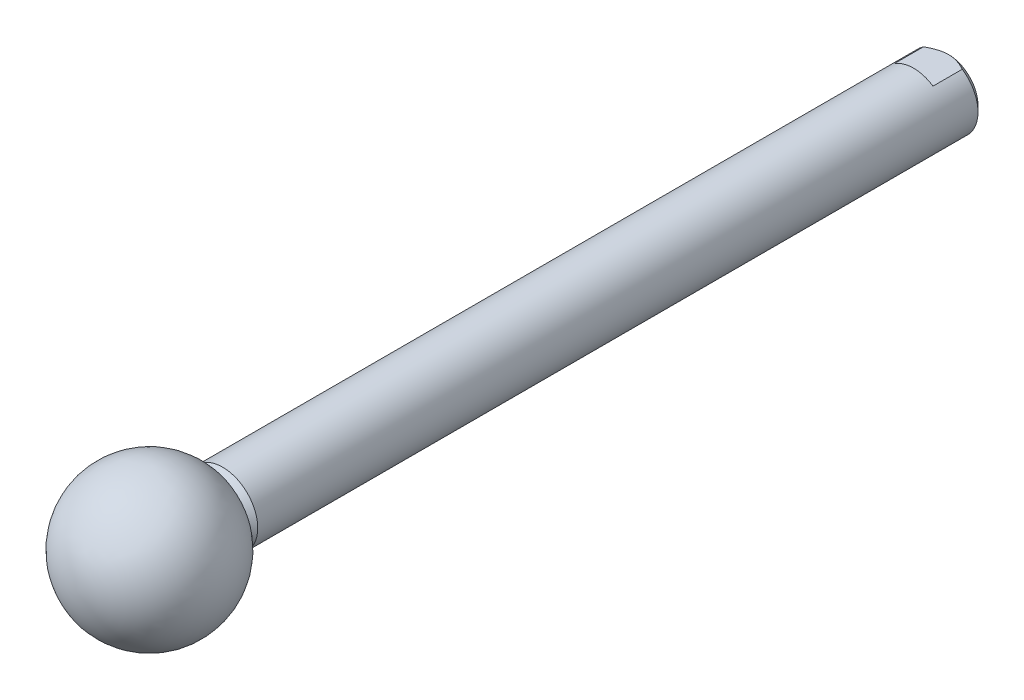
ISO-10303-21;
HEADER;
FILE_DESCRIPTION(('STEP AP214'),'2;1');
FILE_NAME('part.step','',(''),(''),'','','');
FILE_SCHEMA(('AUTOMOTIVE_DESIGN { 1 0 10303 214 1 1 1 1 }'));
ENDSEC;
DATA;
#1=APPLICATION_CONTEXT('core data for automotive mechanical design processes');
#2=APPLICATION_PROTOCOL_DEFINITION('international standard','automotive_design',2000,#1);
#3=PRODUCT_CONTEXT('',#1,'mechanical');
#4=PRODUCT('Part','Part','',(#3));
#5=PRODUCT_RELATED_PRODUCT_CATEGORY('part','',(#4));
#6=PRODUCT_DEFINITION_FORMATION('','',#4);
#7=PRODUCT_DEFINITION_CONTEXT('part definition',#1,'design');
#8=PRODUCT_DEFINITION('design','',#6,#7);
#9=PRODUCT_DEFINITION_SHAPE('','',#8);
#10=(LENGTH_UNIT() NAMED_UNIT(*) SI_UNIT(.MILLI.,.METRE.));
#11=(NAMED_UNIT(*) PLANE_ANGLE_UNIT() SI_UNIT($,.RADIAN.));
#12=(NAMED_UNIT(*) SI_UNIT($,.STERADIAN.) SOLID_ANGLE_UNIT());
#13=UNCERTAINTY_MEASURE_WITH_UNIT(LENGTH_MEASURE(1.E-05),#10,'distance_accuracy_value','');
#14=(GEOMETRIC_REPRESENTATION_CONTEXT(3) GLOBAL_UNCERTAINTY_ASSIGNED_CONTEXT((#13)) GLOBAL_UNIT_ASSIGNED_CONTEXT((#10,
#11,#12)) REPRESENTATION_CONTEXT('',''));
#15=CARTESIAN_POINT('',(0.,0.,0.));
#16=DIRECTION('',(0.,0.,1.));
#17=DIRECTION('',(1.,0.,0.));
#18=AXIS2_PLACEMENT_3D('',#15,#16,#17);
#19=CARTESIAN_POINT('',(0.,0.,0.));
#20=DIRECTION('',(0.,0.,-1.));
#21=DIRECTION('',(0.,-1.,0.));
#22=AXIS2_PLACEMENT_3D('',#19,#20,#21);
#23=CYLINDRICAL_SURFACE('',#22,6.);
#24=CARTESIAN_POINT('',(0.,0.,124.));
#25=DIRECTION('',(0.,0.,-1.));
#26=DIRECTION('',(0.,-1.,0.));
#27=AXIS2_PLACEMENT_3D('',#24,#25,#26);
#28=CIRCLE('',#27,6.);
#29=CARTESIAN_POINT('',(0.,-6.,124.));
#30=VERTEX_POINT('',#29);
#31=EDGE_CURVE('E136',#30,#30,#28,.T.);
#32=ORIENTED_EDGE('',*,*,#31,.T.);
#33=EDGE_LOOP('',(#32));
#34=FACE_BOUND('',#33,.T.);
#35=DIRECTION('',(0.,0.,-1.));
#36=VECTOR('',#35,1.);
#37=CARTESIAN_POINT('',(3.3166247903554,5.,0.));
#38=LINE('',#37,#36);
#39=CARTESIAN_POINT('',(3.31662479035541,5.,6.));
#40=VERTEX_POINT('',#39);
#41=CARTESIAN_POINT('',(3.3166247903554,5.,1.));
#42=VERTEX_POINT('',#41);
#43=EDGE_CURVE('E30',#40,#42,#38,.T.);
#44=ORIENTED_EDGE('',*,*,#43,.F.);
#45=CARTESIAN_POINT('',(0.,0.,6.));
#46=DIRECTION('',(0.,0.,-1.));
#47=DIRECTION('',(0.,-1.,0.));
#48=AXIS2_PLACEMENT_3D('',#45,#46,#47);
#49=CIRCLE('',#48,6.);
#50=CARTESIAN_POINT('',(-3.3166247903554,5.,6.));
#51=VERTEX_POINT('',#50);
#52=EDGE_CURVE('E23',#51,#40,#49,.T.);
#53=ORIENTED_EDGE('',*,*,#52,.F.);
#54=DIRECTION('',(0.,0.,-1.));
#55=VECTOR('',#54,1.);
#56=CARTESIAN_POINT('',(-3.3166247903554,5.,0.));
#57=LINE('',#56,#55);
#58=CARTESIAN_POINT('',(-3.3166247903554,5.,1.));
#59=VERTEX_POINT('',#58);
#60=EDGE_CURVE('E78',#59,#51,#57,.F.);
#61=ORIENTED_EDGE('',*,*,#60,.F.);
#62=CARTESIAN_POINT('',(0.,0.,1.));
#63=DIRECTION('',(0.,0.,1.));
#64=DIRECTION('',(0.,1.,0.));
#65=AXIS2_PLACEMENT_3D('',#62,#63,#64);
#66=CIRCLE('',#65,6.);
#67=CARTESIAN_POINT('',(-3.3166247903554,-5.,1.));
#68=VERTEX_POINT('',#67);
#69=EDGE_CURVE('E38',#59,#68,#66,.T.);
#70=ORIENTED_EDGE('',*,*,#69,.T.);
#71=DIRECTION('',(0.,0.,-1.));
#72=VECTOR('',#71,1.);
#73=CARTESIAN_POINT('',(-3.3166247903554,-5.,0.));
#74=LINE('',#73,#72);
#75=CARTESIAN_POINT('',(-3.3166247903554,-5.,6.));
#76=VERTEX_POINT('',#75);
#77=EDGE_CURVE('E143',#76,#68,#74,.T.);
#78=ORIENTED_EDGE('',*,*,#77,.F.);
#79=CARTESIAN_POINT('',(0.,0.,6.));
#80=DIRECTION('',(0.,0.,-1.));
#81=DIRECTION('',(0.,-1.,0.));
#82=AXIS2_PLACEMENT_3D('',#79,#80,#81);
#83=CIRCLE('',#82,6.);
#84=CARTESIAN_POINT('',(3.31662479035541,-5.,6.));
#85=VERTEX_POINT('',#84);
#86=EDGE_CURVE('E98',#85,#76,#83,.T.);
#87=ORIENTED_EDGE('',*,*,#86,.F.);
#88=DIRECTION('',(0.,0.,-1.));
#89=VECTOR('',#88,1.);
#90=CARTESIAN_POINT('',(3.3166247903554,-5.,0.));
#91=LINE('',#90,#89);
#92=CARTESIAN_POINT('',(3.3166247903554,-5.,1.));
#93=VERTEX_POINT('',#92);
#94=EDGE_CURVE('E145',#93,#85,#91,.F.);
#95=ORIENTED_EDGE('',*,*,#94,.F.);
#96=EDGE_CURVE('E137',#93,#42,#66,.T.);
#97=ORIENTED_EDGE('',*,*,#96,.T.);
#98=EDGE_LOOP('',(#44,#53,#61,#70,#78,#87,#95,#97));
#99=FACE_BOUND('',#98,.T.);
#100=ADVANCED_FACE('F14',(#34,#99),#23,.T.);
#101=CARTESIAN_POINT('',(0.,0.,0.));
#102=DIRECTION('',(0.,0.,1.));
#103=DIRECTION('',(0.,1.,0.));
#104=AXIS2_PLACEMENT_3D('',#101,#102,#103);
#105=CONICAL_SURFACE('',#104,5.,0.785398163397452);
#106=ORIENTED_EDGE('',*,*,#69,.F.);
#107=CARTESIAN_POINT('',(9.80732366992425,5.,6.00834218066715));
#108=CARTESIAN_POINT('',(9.58119349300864,5.,5.80691401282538));
#109=CARTESIAN_POINT('',(9.35437548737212,5.,5.60625083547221));
#110=CARTESIAN_POINT('',(8.8989992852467,5.,5.20686259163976));
#111=CARTESIAN_POINT('',(8.6704409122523,5.,5.00813772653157));
#112=CARTESIAN_POINT('',(8.21030230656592,5.,4.61224686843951));
#113=CARTESIAN_POINT('',(7.97871341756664,5.,4.41509091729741));
#114=CARTESIAN_POINT('',(7.5130005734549,5.,4.02381366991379));
#115=CARTESIAN_POINT('',(7.27887673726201,5.,3.82969223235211));
#116=CARTESIAN_POINT('',(6.79333741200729,5.,3.43377034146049));
#117=CARTESIAN_POINT('',(6.5417271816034,5.,3.2322078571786));
#118=CARTESIAN_POINT('',(6.03402447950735,5.,2.83482453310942));
#119=CARTESIAN_POINT('',(5.77793228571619,5.,2.63900333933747));
#120=CARTESIAN_POINT('',(5.26038239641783,5.,2.25543828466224));
#121=CARTESIAN_POINT('',(4.99893445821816,5.,2.06768138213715));
#122=CARTESIAN_POINT('',(4.60117964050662,5.,1.79423686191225));
#123=CARTESIAN_POINT('',(4.46768156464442,5.,1.70446473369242));
#124=CARTESIAN_POINT('',(4.19854121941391,5.,1.5282000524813));
#125=CARTESIAN_POINT('',(4.06289903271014,5.,1.44170737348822));
#126=CARTESIAN_POINT('',(3.733316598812,5.,1.23815942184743));
#127=CARTESIAN_POINT('',(3.53817282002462,5.,1.12303446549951));
#128=CARTESIAN_POINT('',(3.14206624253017,5.,0.903003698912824));
#129=CARTESIAN_POINT('',(2.94110159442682,5.,0.798101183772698));
#130=CARTESIAN_POINT('',(2.53432452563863,5.,0.602788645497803));
#131=CARTESIAN_POINT('',(2.32856965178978,5.,0.51226023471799));
#132=CARTESIAN_POINT('',(1.91010569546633,5.,0.34897213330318));
#133=CARTESIAN_POINT('',(1.69740135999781,5.,0.276200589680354));
#134=CARTESIAN_POINT('',(1.33583757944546,5.,0.173487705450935));
#135=CARTESIAN_POINT('',(1.18875094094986,5.,0.137316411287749));
#136=CARTESIAN_POINT('',(0.892133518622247,5.,0.0768933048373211));
#137=CARTESIAN_POINT('',(0.742603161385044,5.,0.0526394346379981));
#138=CARTESIAN_POINT('',(0.442508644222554,5.,0.0173401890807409));
#139=CARTESIAN_POINT('',(0.291950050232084,5.,0.00624815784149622));
#140=CARTESIAN_POINT('',(-0.00956074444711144,5.,-0.00226176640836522));
#141=CARTESIAN_POINT('',(-0.160512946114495,5.,0.000320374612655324));
#142=CARTESIAN_POINT('',(-0.460821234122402,5.,0.0189638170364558));
#143=CARTESIAN_POINT('',(-0.610181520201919,5.,0.0349586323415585));
#144=CARTESIAN_POINT('',(-0.907029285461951,5.,0.0794829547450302));
#145=CARTESIAN_POINT('',(-1.05451631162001,5.,0.108015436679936));
#146=CARTESIAN_POINT('',(-1.34850138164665,5.,0.17665719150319));
#147=CARTESIAN_POINT('',(-1.49496927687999,5.,0.216893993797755));
#148=CARTESIAN_POINT('',(-1.78477023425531,5.,0.307206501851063));
#149=CARTESIAN_POINT('',(-1.92810386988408,5.,0.357280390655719));
#150=CARTESIAN_POINT('',(-2.25856233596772,5.,0.483673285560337));
#151=CARTESIAN_POINT('',(-2.44445833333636,5.,0.563190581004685));
#152=CARTESIAN_POINT('',(-2.81095841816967,5.,0.733685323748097));
#153=CARTESIAN_POINT('',(-2.99155953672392,5.,0.824669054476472));
#154=CARTESIAN_POINT('',(-3.3486277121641,5.,1.0158534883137));
#155=CARTESIAN_POINT('',(-3.52507723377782,5.,1.11608668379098));
#156=CARTESIAN_POINT('',(-3.87377641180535,5.,1.32348868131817));
#157=CARTESIAN_POINT('',(-4.04602687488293,5.,1.43065613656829));
#158=CARTESIAN_POINT('',(-4.3784811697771,5.,1.64498122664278));
#159=CARTESIAN_POINT('',(-4.53885738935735,5.,1.75187284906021));
#160=CARTESIAN_POINT('',(-4.85688884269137,5.,1.9696448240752));
#161=CARTESIAN_POINT('',(-5.01454385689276,5.,2.08052549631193));
#162=CARTESIAN_POINT('',(-5.32613837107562,5.,2.30452606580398));
#163=CARTESIAN_POINT('',(-5.48009839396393,5.,2.41761751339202));
#164=CARTESIAN_POINT('',(-5.78600281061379,5.,2.64641369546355));
#165=CARTESIAN_POINT('',(-5.93794772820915,5.,2.76211772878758));
#166=CARTESIAN_POINT('',(-6.08906373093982,5.,2.87887664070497));
#167=B_SPLINE_CURVE_WITH_KNOTS('',3,(#107,#108,#109,#110,#111,#112,#113,#114,#115,#116,#117,
#118,#119,#120,#121,#122,#123,#124,#125,#126,#127,#128,#129,#130,#131,#132,#133,#134,#135,#136,
#137,#138,#139,#140,#141,#142,#143,#144,#145,#146,#147,#148,#149,#150,#151,#152,#153,#154,#155,
#156,#157,#158,#159,#160,#161,#162,#163,#164,#165,#166),.UNSPECIFIED.,.F.,.F.,(4,2,2,2,2,2,2,2,
2,2,2,2,2,2,2,2,2,2,2,2,2,2,2,2,2,2,2,2,2,4),(0.,0.908506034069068,1.81710546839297,
2.72951794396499,3.6418878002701,4.60899241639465,5.57603727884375,6.54145432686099,
7.02404000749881,7.50660712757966,8.18608499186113,8.86578115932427,9.53955092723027,
10.2128697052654,10.6668587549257,11.1207693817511,11.5730661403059,12.0253640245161,
12.4754330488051,12.9256089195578,13.3808863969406,13.836079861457,14.4421198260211,
15.0484933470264,15.6570845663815,16.2655579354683,16.8436881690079,17.4218648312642,
17.9949317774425,18.5678467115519),.UNSPECIFIED.);
#168=CARTESIAN_POINT('',(0.,5.,0.));
#169=VERTEX_POINT('',#168);
#170=EDGE_CURVE('E65',#59,#169,#167,.F.);
#171=ORIENTED_EDGE('',*,*,#170,.T.);
#172=CARTESIAN_POINT('',(0.,0.,0.));
#173=DIRECTION('',(0.,0.,1.));
#174=DIRECTION('',(0.,1.,0.));
#175=AXIS2_PLACEMENT_3D('',#172,#173,#174);
#176=CIRCLE('',#175,5.);
#177=CARTESIAN_POINT('',(0.,-5.,0.));
#178=VERTEX_POINT('',#177);
#179=EDGE_CURVE('E77',#178,#169,#176,.F.);
#180=ORIENTED_EDGE('',*,*,#179,.F.);
#181=CARTESIAN_POINT('',(9.80732366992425,-5.,6.00834218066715));
#182=CARTESIAN_POINT('',(9.58119349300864,-5.,5.80691401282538));
#183=CARTESIAN_POINT('',(9.35437548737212,-5.,5.60625083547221));
#184=CARTESIAN_POINT('',(8.8989992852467,-5.,5.20686259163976));
#185=CARTESIAN_POINT('',(8.6704409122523,-5.,5.00813772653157));
#186=CARTESIAN_POINT('',(8.21030230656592,-5.,4.61224686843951));
#187=CARTESIAN_POINT('',(7.97871341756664,-5.,4.41509091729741));
#188=CARTESIAN_POINT('',(7.5130005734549,-5.,4.02381366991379));
#189=CARTESIAN_POINT('',(7.27887673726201,-5.,3.82969223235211));
#190=CARTESIAN_POINT('',(6.79333741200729,-5.,3.43377034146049));
#191=CARTESIAN_POINT('',(6.5417271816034,-5.,3.2322078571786));
#192=CARTESIAN_POINT('',(6.03402447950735,-5.,2.83482453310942));
#193=CARTESIAN_POINT('',(5.77793228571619,-5.,2.63900333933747));
#194=CARTESIAN_POINT('',(5.26038239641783,-5.,2.25543828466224));
#195=CARTESIAN_POINT('',(4.99893445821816,-5.,2.06768138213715));
#196=CARTESIAN_POINT('',(4.60117964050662,-5.,1.79423686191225));
#197=CARTESIAN_POINT('',(4.46768156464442,-5.,1.70446473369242));
#198=CARTESIAN_POINT('',(4.19854121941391,-5.,1.5282000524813));
#199=CARTESIAN_POINT('',(4.06289903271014,-5.,1.44170737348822));
#200=CARTESIAN_POINT('',(3.733316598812,-5.,1.23815942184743));
#201=CARTESIAN_POINT('',(3.53817282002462,-5.,1.12303446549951));
#202=CARTESIAN_POINT('',(3.14206624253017,-5.,0.903003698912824));
#203=CARTESIAN_POINT('',(2.94110159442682,-5.,0.798101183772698));
#204=CARTESIAN_POINT('',(2.53432452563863,-5.,0.602788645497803));
#205=CARTESIAN_POINT('',(2.32856965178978,-5.,0.51226023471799));
#206=CARTESIAN_POINT('',(1.91010569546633,-5.,0.34897213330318));
#207=CARTESIAN_POINT('',(1.69740135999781,-5.,0.276200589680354));
#208=CARTESIAN_POINT('',(1.33583757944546,-5.,0.173487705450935));
#209=CARTESIAN_POINT('',(1.18875094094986,-5.,0.137316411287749));
#210=CARTESIAN_POINT('',(0.892133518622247,-5.,0.0768933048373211));
#211=CARTESIAN_POINT('',(0.742603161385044,-5.,0.0526394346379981));
#212=CARTESIAN_POINT('',(0.442508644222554,-5.,0.0173401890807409));
#213=CARTESIAN_POINT('',(0.291950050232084,-5.,0.00624815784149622));
#214=CARTESIAN_POINT('',(-0.00956074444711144,-5.,-0.00226176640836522));
#215=CARTESIAN_POINT('',(-0.160512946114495,-5.,0.000320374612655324));
#216=CARTESIAN_POINT('',(-0.460821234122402,-5.,0.0189638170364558));
#217=CARTESIAN_POINT('',(-0.610181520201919,-5.,0.0349586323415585));
#218=CARTESIAN_POINT('',(-0.907029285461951,-5.,0.0794829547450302));
#219=CARTESIAN_POINT('',(-1.05451631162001,-5.,0.108015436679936));
#220=CARTESIAN_POINT('',(-1.34850138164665,-5.,0.17665719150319));
#221=CARTESIAN_POINT('',(-1.49496927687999,-5.,0.216893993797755));
#222=CARTESIAN_POINT('',(-1.78477023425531,-5.,0.307206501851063));
#223=CARTESIAN_POINT('',(-1.92810386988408,-5.,0.357280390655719));
#224=CARTESIAN_POINT('',(-2.25856233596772,-5.,0.483673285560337));
#225=CARTESIAN_POINT('',(-2.44445833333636,-5.,0.563190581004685));
#226=CARTESIAN_POINT('',(-2.81095841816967,-5.,0.733685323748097));
#227=CARTESIAN_POINT('',(-2.99155953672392,-5.,0.824669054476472));
#228=CARTESIAN_POINT('',(-3.3486277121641,-5.,1.0158534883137));
#229=CARTESIAN_POINT('',(-3.52507723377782,-5.,1.11608668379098));
#230=CARTESIAN_POINT('',(-3.87377641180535,-5.,1.32348868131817));
#231=CARTESIAN_POINT('',(-4.04602687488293,-5.,1.43065613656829));
#232=CARTESIAN_POINT('',(-4.3784811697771,-5.,1.64498122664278));
#233=CARTESIAN_POINT('',(-4.53885738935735,-5.,1.75187284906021));
#234=CARTESIAN_POINT('',(-4.85688884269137,-5.,1.9696448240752));
#235=CARTESIAN_POINT('',(-5.01454385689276,-5.,2.08052549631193));
#236=CARTESIAN_POINT('',(-5.32613837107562,-5.,2.30452606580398));
#237=CARTESIAN_POINT('',(-5.48009839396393,-5.,2.41761751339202));
#238=CARTESIAN_POINT('',(-5.78600281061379,-5.,2.64641369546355));
#239=CARTESIAN_POINT('',(-5.93794772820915,-5.,2.76211772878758));
#240=CARTESIAN_POINT('',(-6.08906373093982,-5.,2.87887664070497));
#241=B_SPLINE_CURVE_WITH_KNOTS('',3,(#181,#182,#183,#184,#185,#186,#187,#188,#189,#190,#191,
#192,#193,#194,#195,#196,#197,#198,#199,#200,#201,#202,#203,#204,#205,#206,#207,#208,#209,#210,
#211,#212,#213,#214,#215,#216,#217,#218,#219,#220,#221,#222,#223,#224,#225,#226,#227,#228,#229,
#230,#231,#232,#233,#234,#235,#236,#237,#238,#239,#240),.UNSPECIFIED.,.F.,.F.,(4,2,2,2,2,2,2,2,
2,2,2,2,2,2,2,2,2,2,2,2,2,2,2,2,2,2,2,2,2,4),(0.,0.908506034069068,1.81710546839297,
2.72951794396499,3.6418878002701,4.60899241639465,5.57603727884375,6.54145432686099,
7.02404000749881,7.50660712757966,8.18608499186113,8.86578115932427,9.53955092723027,
10.2128697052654,10.6668587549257,11.1207693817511,11.5730661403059,12.0253640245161,
12.4754330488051,12.9256089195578,13.3808863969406,13.836079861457,14.4421198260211,
15.0484933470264,15.6570845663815,16.2655579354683,16.8436881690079,17.4218648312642,
17.9949317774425,18.5678467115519),.UNSPECIFIED.);
#242=EDGE_CURVE('E88',#178,#68,#241,.T.);
#243=ORIENTED_EDGE('',*,*,#242,.T.);
#244=EDGE_LOOP('',(#106,#171,#180,#243));
#245=FACE_BOUND('',#244,.T.);
#246=ADVANCED_FACE('F74',(#245),#105,.T.);
#247=EDGE_CURVE('E80',#169,#178,#176,.F.);
#248=ORIENTED_EDGE('',*,*,#247,.F.);
#249=EDGE_CURVE('E62',#169,#42,#167,.F.);
#250=ORIENTED_EDGE('',*,*,#249,.T.);
#251=ORIENTED_EDGE('',*,*,#96,.F.);
#252=EDGE_CURVE('E82',#93,#178,#241,.T.);
#253=ORIENTED_EDGE('',*,*,#252,.T.);
#254=EDGE_LOOP('',(#248,#250,#251,#253));
#255=FACE_BOUND('',#254,.T.);
#256=ADVANCED_FACE('F81',(#255),#105,.T.);
#257=CARTESIAN_POINT('',(0.,0.,0.));
#258=DIRECTION('',(0.,0.,1.));
#259=DIRECTION('',(0.,1.,0.));
#260=AXIS2_PLACEMENT_3D('',#257,#258,#259);
#261=PLANE('',#260);
#262=CARTESIAN_POINT('',(0.,0.,0.));
#263=DIRECTION('',(0.,0.,-1.));
#264=DIRECTION('',(0.,-1.,0.));
#265=AXIS2_PLACEMENT_3D('',#262,#263,#264);
#266=CIRCLE('',#265,3.5);
#267=CARTESIAN_POINT('',(0.,-3.5,0.));
#268=VERTEX_POINT('',#267);
#269=EDGE_CURVE('E140',#268,#268,#266,.T.);
#270=ORIENTED_EDGE('',*,*,#269,.F.);
#271=EDGE_LOOP('',(#270));
#272=FACE_BOUND('',#271,.T.);
#273=ORIENTED_EDGE('',*,*,#179,.T.);
#274=ORIENTED_EDGE('',*,*,#247,.T.);
#275=EDGE_LOOP('',(#273,#274));
#276=FACE_BOUND('',#275,.T.);
#277=ADVANCED_FACE('F87',(#272,#276),#261,.F.);
#278=CARTESIAN_POINT('',(0.,0.,125.));
#279=DIRECTION('',(0.,0.,-1.));
#280=DIRECTION('',(0.,-1.,0.));
#281=AXIS2_PLACEMENT_3D('',#278,#279,#280);
#282=PLANE('',#281);
#283=CARTESIAN_POINT('',(0.,0.,125.));
#284=DIRECTION('',(0.,0.,-1.));
#285=DIRECTION('',(0.0348723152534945,0.999391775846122,0.));
#286=AXIS2_PLACEMENT_3D('',#283,#284,#285);
#287=CIRCLE('',#286,4.89898);
#288=CARTESIAN_POINT('',(0.170838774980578,4.89600032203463,125.));
#289=VERTEX_POINT('',#288);
#290=EDGE_CURVE('E9',#289,#289,#287,.T.);
#291=ORIENTED_EDGE('',*,*,#290,.T.);
#292=EDGE_LOOP('',(#291));
#293=FACE_BOUND('',#292,.T.);
#294=CARTESIAN_POINT('',(0.,0.,125.));
#295=DIRECTION('',(0.,0.,-1.));
#296=DIRECTION('',(0.,-1.,0.));
#297=AXIS2_PLACEMENT_3D('',#294,#295,#296);
#298=CIRCLE('',#297,5.);
#299=CARTESIAN_POINT('',(0.,-5.,125.));
#300=VERTEX_POINT('',#299);
#301=EDGE_CURVE('E85',#300,#300,#298,.F.);
#302=ORIENTED_EDGE('',*,*,#301,.T.);
#303=EDGE_LOOP('',(#302));
#304=FACE_BOUND('',#303,.T.);
#305=ADVANCED_FACE('F116',(#293,#304),#282,.F.);
#306=CARTESIAN_POINT('',(0.,0.,124.));
#307=DIRECTION('',(0.,0.,-1.));
#308=DIRECTION('',(0.,-1.,0.));
#309=AXIS2_PLACEMENT_3D('',#306,#307,#308);
#310=CONICAL_SURFACE('',#309,6.,0.78539816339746);
#311=ORIENTED_EDGE('',*,*,#301,.F.);
#312=EDGE_LOOP('',(#311));
#313=FACE_BOUND('',#312,.T.);
#314=ORIENTED_EDGE('',*,*,#31,.F.);
#315=EDGE_LOOP('',(#314));
#316=FACE_BOUND('',#315,.T.);
#317=ADVANCED_FACE('F114',(#313,#316),#310,.T.);
#318=CARTESIAN_POINT('',(0.,0.,0.));
#319=DIRECTION('',(0.,0.,-1.));
#320=DIRECTION('',(0.,-1.,0.));
#321=AXIS2_PLACEMENT_3D('',#318,#319,#320);
#322=CONICAL_SURFACE('',#321,3.5,0.785398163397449);
#323=CARTESIAN_POINT('',(0.,0.,0.5));
#324=DIRECTION('',(0.,0.,-1.));
#325=DIRECTION('',(0.,-1.,0.));
#326=AXIS2_PLACEMENT_3D('',#323,#324,#325);
#327=CIRCLE('',#326,3.);
#328=CARTESIAN_POINT('',(0.,-3.,0.5));
#329=VERTEX_POINT('',#328);
#330=EDGE_CURVE('E18',#329,#329,#327,.F.);
#331=ORIENTED_EDGE('',*,*,#330,.T.);
#332=EDGE_LOOP('',(#331));
#333=FACE_BOUND('',#332,.T.);
#334=ORIENTED_EDGE('',*,*,#269,.T.);
#335=EDGE_LOOP('',(#334));
#336=FACE_BOUND('',#335,.T.);
#337=ADVANCED_FACE('F111',(#333,#336),#322,.F.);
#338=CARTESIAN_POINT('',(7.2759669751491,-5.,6.));
#339=DIRECTION('',(0.,0.,-1.));
#340=DIRECTION('',(0.,-1.,0.));
#341=AXIS2_PLACEMENT_3D('',#338,#339,#340);
#342=PLANE('',#341);
#343=ORIENTED_EDGE('',*,*,#86,.T.);
#344=DIRECTION('',(-1.,0.,0.));
#345=VECTOR('',#344,1.);
#346=CARTESIAN_POINT('',(-7.53377682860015,-5.,6.));
#347=LINE('',#346,#345);
#348=EDGE_CURVE('E147',#85,#76,#347,.T.);
#349=ORIENTED_EDGE('',*,*,#348,.F.);
#350=EDGE_LOOP('',(#343,#349));
#351=FACE_BOUND('',#350,.T.);
#352=ADVANCED_FACE('F108',(#351),#342,.T.);
#353=CARTESIAN_POINT('',(-7.53377682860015,-5.,6.));
#354=DIRECTION('',(0.,-1.,0.));
#355=DIRECTION('',(1.,0.,0.));
#356=AXIS2_PLACEMENT_3D('',#353,#354,#355);
#357=PLANE('',#356);
#358=ORIENTED_EDGE('',*,*,#77,.T.);
#359=ORIENTED_EDGE('',*,*,#242,.F.);
#360=ORIENTED_EDGE('',*,*,#252,.F.);
#361=ORIENTED_EDGE('',*,*,#94,.T.);
#362=ORIENTED_EDGE('',*,*,#348,.T.);
#363=EDGE_LOOP('',(#358,#359,#360,#361,#362));
#364=FACE_BOUND('',#363,.T.);
#365=ADVANCED_FACE('F102',(#364),#357,.T.);
#366=CARTESIAN_POINT('',(-7.53377682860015,8.26559147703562,6.));
#367=DIRECTION('',(0.,0.,-1.));
#368=DIRECTION('',(0.,-1.,0.));
#369=AXIS2_PLACEMENT_3D('',#366,#367,#368);
#370=PLANE('',#369);
#371=ORIENTED_EDGE('',*,*,#52,.T.);
#372=DIRECTION('',(1.,0.,0.));
#373=VECTOR('',#372,1.);
#374=CARTESIAN_POINT('',(-7.53377682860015,5.,6.));
#375=LINE('',#374,#373);
#376=EDGE_CURVE('E70',#51,#40,#375,.T.);
#377=ORIENTED_EDGE('',*,*,#376,.F.);
#378=EDGE_LOOP('',(#371,#377));
#379=FACE_BOUND('',#378,.T.);
#380=ADVANCED_FACE('F107',(#379),#370,.T.);
#381=CARTESIAN_POINT('',(-7.53377682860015,5.,6.));
#382=DIRECTION('',(0.,1.,0.));
#383=DIRECTION('',(-1.,0.,0.));
#384=AXIS2_PLACEMENT_3D('',#381,#382,#383);
#385=PLANE('',#384);
#386=ORIENTED_EDGE('',*,*,#43,.T.);
#387=ORIENTED_EDGE('',*,*,#249,.F.);
#388=ORIENTED_EDGE('',*,*,#170,.F.);
#389=ORIENTED_EDGE('',*,*,#60,.T.);
#390=ORIENTED_EDGE('',*,*,#376,.T.);
#391=EDGE_LOOP('',(#386,#387,#388,#389,#390));
#392=FACE_BOUND('',#391,.T.);
#393=ADVANCED_FACE('F64',(#392),#385,.T.);
#394=CARTESIAN_POINT('',(1.11022302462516E-13,0.,136.5));
#395=DIRECTION('',(-0.0348723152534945,-0.999391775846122,0.));
#396=DIRECTION('',(0.999391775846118,-0.0348723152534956,0.));
#397=AXIS2_PLACEMENT_3D('',#394,#395,#396);
#398=SPHERICAL_SURFACE('',#397,12.5000001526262);
#399=CARTESIAN_POINT('',(1.11022302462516E-13,0.,136.5));
#400=DIRECTION('',(0.,0.,-1.));
#401=DIRECTION('',(0.0348723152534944,0.99939177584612,0.));
#402=AXIS2_PLACEMENT_3D('',#399,#400,#401);
#403=SPHERICAL_SURFACE('',#402,12.5000001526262);
#404=ORIENTED_EDGE('',*,*,#290,.F.);
#405=EDGE_LOOP('',(#404));
#406=FACE_BOUND('',#405,.T.);
#407=ADVANCED_FACE('F16',(#406),#403,.T.);
#408=CARTESIAN_POINT('',(0.,0.,12.));
#409=DIRECTION('',(0.,0.,-1.));
#410=DIRECTION('',(0.,-1.,0.));
#411=AXIS2_PLACEMENT_3D('',#408,#409,#410);
#412=PLANE('',#411);
#413=CARTESIAN_POINT('',(0.,0.,12.));
#414=DIRECTION('',(0.,0.,-1.));
#415=DIRECTION('',(0.,-1.,0.));
#416=AXIS2_PLACEMENT_3D('',#413,#414,#415);
#417=CIRCLE('',#416,3.);
#418=CARTESIAN_POINT('',(0.,-3.,12.));
#419=VERTEX_POINT('',#418);
#420=EDGE_CURVE('E177',#419,#419,#417,.T.);
#421=ORIENTED_EDGE('',*,*,#420,.T.);
#422=EDGE_LOOP('',(#421));
#423=FACE_BOUND('',#422,.T.);
#424=ADVANCED_FACE('F166',(#423),#412,.T.);
#425=CARTESIAN_POINT('',(0.,0.,12.));
#426=DIRECTION('',(0.,0.,-1.));
#427=DIRECTION('',(0.,-1.,0.));
#428=AXIS2_PLACEMENT_3D('',#425,#426,#427);
#429=CYLINDRICAL_SURFACE('',#428,3.);
#430=ORIENTED_EDGE('',*,*,#420,.F.);
#431=EDGE_LOOP('',(#430));
#432=FACE_BOUND('',#431,.T.);
#433=ORIENTED_EDGE('',*,*,#330,.F.);
#434=EDGE_LOOP('',(#433));
#435=FACE_BOUND('',#434,.T.);
#436=ADVANCED_FACE('F163',(#432,#435),#429,.F.);
#437=CLOSED_SHELL('',(#100,#246,#256,#277,#305,#317,#337,#352,#365,#380,#393,#407,#424,#436));
#438=MANIFOLD_SOLID_BREP('B1',#437);
#439=ADVANCED_BREP_SHAPE_REPRESENTATION('',(#18,#438),#14);
#440=SHAPE_DEFINITION_REPRESENTATION(#9,#439);
ENDSEC;
END-ISO-10303-21;
